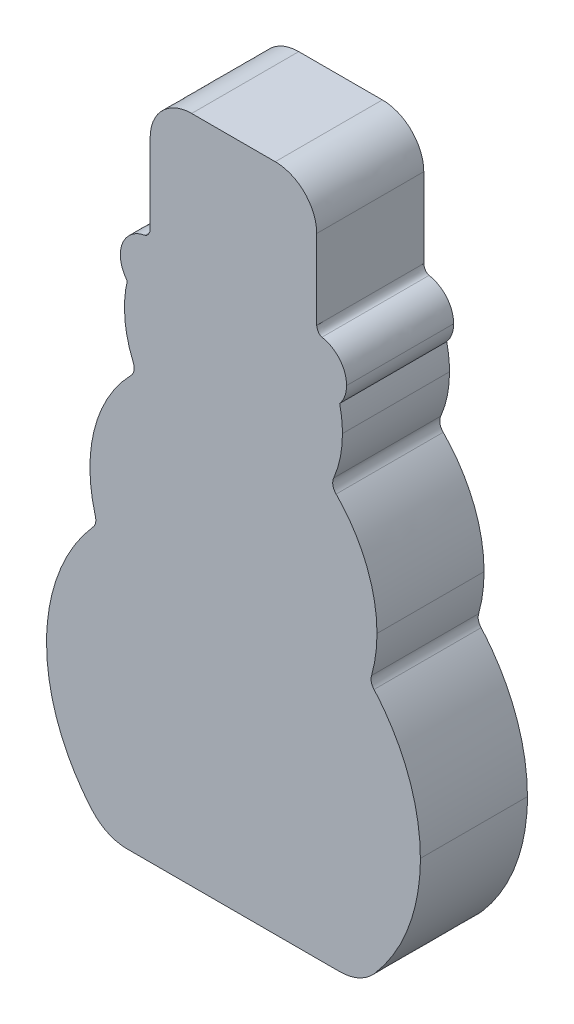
ISO-10303-21;
HEADER;
FILE_DESCRIPTION(('STEP AP214'),'2;1');
FILE_NAME('part.step','',(''),(''),'','','');
FILE_SCHEMA(('AUTOMOTIVE_DESIGN { 1 0 10303 214 1 1 1 1 }'));
ENDSEC;
DATA;
#1=APPLICATION_CONTEXT('core data for automotive mechanical design processes');
#2=APPLICATION_PROTOCOL_DEFINITION('international standard','automotive_design',2000,#1);
#3=PRODUCT_CONTEXT('',#1,'mechanical');
#4=PRODUCT('Part','Part','',(#3));
#5=PRODUCT_RELATED_PRODUCT_CATEGORY('part','',(#4));
#6=PRODUCT_DEFINITION_FORMATION('','',#4);
#7=PRODUCT_DEFINITION_CONTEXT('part definition',#1,'design');
#8=PRODUCT_DEFINITION('design','',#6,#7);
#9=PRODUCT_DEFINITION_SHAPE('','',#8);
#10=(LENGTH_UNIT() NAMED_UNIT(*) SI_UNIT(.MILLI.,.METRE.));
#11=(NAMED_UNIT(*) PLANE_ANGLE_UNIT() SI_UNIT($,.RADIAN.));
#12=(NAMED_UNIT(*) SI_UNIT($,.STERADIAN.) SOLID_ANGLE_UNIT());
#13=UNCERTAINTY_MEASURE_WITH_UNIT(LENGTH_MEASURE(1.E-05),#10,'distance_accuracy_value','');
#14=(GEOMETRIC_REPRESENTATION_CONTEXT(3) GLOBAL_UNCERTAINTY_ASSIGNED_CONTEXT((#13)) GLOBAL_UNIT_ASSIGNED_CONTEXT((#10,
#11,#12)) REPRESENTATION_CONTEXT('',''));
#15=CARTESIAN_POINT('',(0.,0.,0.));
#16=DIRECTION('',(0.,0.,1.));
#17=DIRECTION('',(1.,0.,0.));
#18=AXIS2_PLACEMENT_3D('',#15,#16,#17);
#19=CARTESIAN_POINT('',(451.275499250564,288.007793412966,8.));
#20=CARTESIAN_POINT('',(451.138199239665,287.415293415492,8.));
#21=CARTESIAN_POINT('',(451.065699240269,286.797993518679,8.));
#22=CARTESIAN_POINT('',(451.065699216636,286.163793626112,8.));
#23=B_SPLINE_CURVE_WITH_KNOTS('',3,(#19,#20,#21,#22),.UNSPECIFIED.,.F.,.F.,(4,4),
(0.939393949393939,1.),.UNSPECIFIED.);
#24=DIRECTION('',(0.,0.,-1.));
#25=VECTOR('',#24,1.);
#26=SURFACE_OF_LINEAR_EXTRUSION('',#23,#25);
#27=CARTESIAN_POINT('',(451.275499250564,288.007793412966,0.));
#28=CARTESIAN_POINT('',(451.138199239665,287.415293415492,0.));
#29=CARTESIAN_POINT('',(451.065699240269,286.797993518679,0.));
#30=CARTESIAN_POINT('',(451.065699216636,286.163793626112,0.));
#31=B_SPLINE_CURVE_WITH_KNOTS('',3,(#27,#28,#29,#30),.UNSPECIFIED.,.F.,.F.,(4,4),
(0.939393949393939,1.),.UNSPECIFIED.);
#32=CARTESIAN_POINT('',(451.275499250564,288.007793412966,0.));
#33=VERTEX_POINT('',#32);
#34=CARTESIAN_POINT('',(451.065699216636,286.163793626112,0.));
#35=VERTEX_POINT('',#34);
#36=EDGE_CURVE('E652',#33,#35,#31,.T.);
#37=ORIENTED_EDGE('',*,*,#36,.T.);
#38=DIRECTION('',(0.,0.,-1.));
#39=VECTOR('',#38,1.);
#40=CARTESIAN_POINT('',(451.065699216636,286.163793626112,8.));
#41=LINE('',#40,#39);
#42=CARTESIAN_POINT('',(451.065699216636,286.163793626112,8.));
#43=VERTEX_POINT('',#42);
#44=EDGE_CURVE('E11',#43,#35,#41,.T.);
#45=ORIENTED_EDGE('',*,*,#44,.F.);
#46=CARTESIAN_POINT('',(451.275499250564,288.007793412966,8.));
#47=VERTEX_POINT('',#46);
#48=EDGE_CURVE('E830',#47,#43,#23,.T.);
#49=ORIENTED_EDGE('',*,*,#48,.F.);
#50=DIRECTION('',(0.,0.,-1.));
#51=VECTOR('',#50,1.);
#52=CARTESIAN_POINT('',(451.275499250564,288.007793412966,8.));
#53=LINE('',#52,#51);
#54=EDGE_CURVE('E259',#47,#33,#53,.T.);
#55=ORIENTED_EDGE('',*,*,#54,.T.);
#56=EDGE_LOOP('',(#37,#45,#49,#55));
#57=FACE_BOUND('',#56,.T.);
#58=ADVANCED_FACE('F34',(#57),#26,.F.);
#59=CARTESIAN_POINT('',(451.065699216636,286.163793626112,8.));
#60=CARTESIAN_POINT('',(451.065699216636,285.064693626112,8.));
#61=CARTESIAN_POINT('',(451.285299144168,283.98009398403,8.));
#62=CARTESIAN_POINT('',(451.71689893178,282.969194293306,8.));
#63=B_SPLINE_CURVE_WITH_KNOTS('',3,(#59,#60,#61,#62),.UNSPECIFIED.,.F.,.F.,(4,4),
(0.909090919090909,0.939393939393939),.UNSPECIFIED.);
#64=DIRECTION('',(0.,0.,-1.));
#65=VECTOR('',#64,1.);
#66=SURFACE_OF_LINEAR_EXTRUSION('',#63,#65);
#67=CARTESIAN_POINT('',(451.065699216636,286.163793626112,0.));
#68=CARTESIAN_POINT('',(451.065699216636,285.064693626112,0.));
#69=CARTESIAN_POINT('',(451.285299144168,283.98009398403,0.));
#70=CARTESIAN_POINT('',(451.71689893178,282.969194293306,0.));
#71=B_SPLINE_CURVE_WITH_KNOTS('',3,(#67,#68,#69,#70),.UNSPECIFIED.,.F.,.F.,(4,4),
(0.909090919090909,0.939393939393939),.UNSPECIFIED.);
#72=CARTESIAN_POINT('',(451.71689893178,282.969194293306,0.));
#73=VERTEX_POINT('',#72);
#74=EDGE_CURVE('E646',#35,#73,#71,.T.);
#75=ORIENTED_EDGE('',*,*,#74,.T.);
#76=DIRECTION('',(0.,0.,-1.));
#77=VECTOR('',#76,1.);
#78=CARTESIAN_POINT('',(451.71689893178,282.969194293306,8.));
#79=LINE('',#78,#77);
#80=CARTESIAN_POINT('',(451.71689893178,282.969194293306,8.));
#81=VERTEX_POINT('',#80);
#82=EDGE_CURVE('E43',#81,#73,#79,.T.);
#83=ORIENTED_EDGE('',*,*,#82,.F.);
#84=EDGE_CURVE('E160',#43,#81,#63,.T.);
#85=ORIENTED_EDGE('',*,*,#84,.F.);
#86=ORIENTED_EDGE('',*,*,#44,.T.);
#87=EDGE_LOOP('',(#75,#83,#85,#86));
#88=FACE_BOUND('',#87,.T.);
#89=ADVANCED_FACE('F861',(#88),#66,.F.);
#90=CARTESIAN_POINT('',(451.71689893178,282.969194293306,8.));
#91=CARTESIAN_POINT('',(451.862498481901,282.628294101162,8.));
#92=CARTESIAN_POINT('',(451.797198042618,282.279094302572,8.));
#93=CARTESIAN_POINT('',(451.538097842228,282.013994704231,8.));
#94=B_SPLINE_CURVE_WITH_KNOTS('',3,(#90,#91,#92,#93),.UNSPECIFIED.,.F.,.F.,(4,4),
(0.878787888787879,0.909090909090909),.UNSPECIFIED.);
#95=DIRECTION('',(0.,0.,-1.));
#96=VECTOR('',#95,1.);
#97=SURFACE_OF_LINEAR_EXTRUSION('',#94,#96);
#98=CARTESIAN_POINT('',(451.71689893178,282.969194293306,0.));
#99=CARTESIAN_POINT('',(451.862498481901,282.628294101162,0.));
#100=CARTESIAN_POINT('',(451.797198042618,282.279094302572,0.));
#101=CARTESIAN_POINT('',(451.538097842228,282.013994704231,0.));
#102=B_SPLINE_CURVE_WITH_KNOTS('',3,(#98,#99,#100,#101),.UNSPECIFIED.,.F.,.F.,(4,4),
(0.878787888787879,0.909090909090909),.UNSPECIFIED.);
#103=CARTESIAN_POINT('',(451.538097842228,282.013994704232,0.));
#104=VERTEX_POINT('',#103);
#105=EDGE_CURVE('E640',#73,#104,#102,.T.);
#106=ORIENTED_EDGE('',*,*,#105,.T.);
#107=DIRECTION('',(0.,0.,-1.));
#108=VECTOR('',#107,1.);
#109=CARTESIAN_POINT('',(451.538097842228,282.013994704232,8.));
#110=LINE('',#109,#108);
#111=CARTESIAN_POINT('',(451.538097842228,282.013994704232,8.));
#112=VERTEX_POINT('',#111);
#113=EDGE_CURVE('E632',#112,#104,#110,.T.);
#114=ORIENTED_EDGE('',*,*,#113,.F.);
#115=EDGE_CURVE('E641',#81,#112,#94,.T.);
#116=ORIENTED_EDGE('',*,*,#115,.F.);
#117=ORIENTED_EDGE('',*,*,#82,.T.);
#118=EDGE_LOOP('',(#106,#114,#116,#117));
#119=FACE_BOUND('',#118,.T.);
#120=ADVANCED_FACE('F638',(#119),#97,.F.);
#121=CARTESIAN_POINT('',(451.538097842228,282.013994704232,8.));
#122=CARTESIAN_POINT('',(449.575298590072,280.00509397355,8.));
#123=CARTESIAN_POINT('',(448.485099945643,277.330094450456,8.));
#124=CARTESIAN_POINT('',(448.48510063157,274.521095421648,8.));
#125=B_SPLINE_CURVE_WITH_KNOTS('',3,(#121,#122,#123,#124),.UNSPECIFIED.,.F.,.F.,(4,4),
(0.848484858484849,0.878787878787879),.UNSPECIFIED.);
#126=DIRECTION('',(0.,0.,-1.));
#127=VECTOR('',#126,1.);
#128=SURFACE_OF_LINEAR_EXTRUSION('',#125,#127);
#129=CARTESIAN_POINT('',(451.538097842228,282.013994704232,0.));
#130=CARTESIAN_POINT('',(449.575298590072,280.00509397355,0.));
#131=CARTESIAN_POINT('',(448.485099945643,277.330094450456,0.));
#132=CARTESIAN_POINT('',(448.48510063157,274.521095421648,0.));
#133=B_SPLINE_CURVE_WITH_KNOTS('',3,(#129,#130,#131,#132),.UNSPECIFIED.,.F.,.F.,(4,4),
(0.848484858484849,0.878787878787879),.UNSPECIFIED.);
#134=CARTESIAN_POINT('',(448.48510063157,274.521095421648,0.));
#135=VERTEX_POINT('',#134);
#136=EDGE_CURVE('E648',#104,#135,#133,.T.);
#137=ORIENTED_EDGE('',*,*,#136,.T.);
#138=DIRECTION('',(0.,0.,-1.));
#139=VECTOR('',#138,1.);
#140=CARTESIAN_POINT('',(448.48510063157,274.521095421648,8.));
#141=LINE('',#140,#139);
#142=CARTESIAN_POINT('',(448.48510063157,274.521095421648,8.));
#143=VERTEX_POINT('',#142);
#144=EDGE_CURVE('E629',#143,#135,#141,.T.);
#145=ORIENTED_EDGE('',*,*,#144,.F.);
#146=EDGE_CURVE('E873',#112,#143,#125,.T.);
#147=ORIENTED_EDGE('',*,*,#146,.F.);
#148=ORIENTED_EDGE('',*,*,#113,.T.);
#149=EDGE_LOOP('',(#137,#145,#147,#148));
#150=FACE_BOUND('',#149,.T.);
#151=ADVANCED_FACE('F866',(#150),#128,.F.);
#152=CARTESIAN_POINT('',(448.48510063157,274.521095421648,8.));
#153=CARTESIAN_POINT('',(448.485100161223,273.534395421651,8.));
#154=CARTESIAN_POINT('',(448.619499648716,272.552295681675,8.));
#155=CARTESIAN_POINT('',(448.887699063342,271.602595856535,8.));
#156=B_SPLINE_CURVE_WITH_KNOTS('',3,(#152,#153,#154,#155),.UNSPECIFIED.,.F.,.F.,(4,4),
(0.818181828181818,0.848484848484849),.UNSPECIFIED.);
#157=DIRECTION('',(0.,0.,-1.));
#158=VECTOR('',#157,1.);
#159=SURFACE_OF_LINEAR_EXTRUSION('',#156,#158);
#160=CARTESIAN_POINT('',(448.48510063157,274.521095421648,0.));
#161=CARTESIAN_POINT('',(448.485100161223,273.534395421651,0.));
#162=CARTESIAN_POINT('',(448.619499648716,272.552295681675,0.));
#163=CARTESIAN_POINT('',(448.887699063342,271.602595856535,0.));
#164=B_SPLINE_CURVE_WITH_KNOTS('',3,(#160,#161,#162,#163),.UNSPECIFIED.,.F.,.F.,(4,4),
(0.818181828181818,0.848484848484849),.UNSPECIFIED.);
#165=CARTESIAN_POINT('',(448.887699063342,271.602595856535,0.));
#166=VERTEX_POINT('',#165);
#167=EDGE_CURVE('E650',#135,#166,#164,.T.);
#168=ORIENTED_EDGE('',*,*,#167,.T.);
#169=DIRECTION('',(0.,0.,-1.));
#170=VECTOR('',#169,1.);
#171=CARTESIAN_POINT('',(448.887699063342,271.602595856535,8.));
#172=LINE('',#171,#170);
#173=CARTESIAN_POINT('',(448.887699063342,271.602595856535,8.));
#174=VERTEX_POINT('',#173);
#175=EDGE_CURVE('E626',#174,#166,#172,.T.);
#176=ORIENTED_EDGE('',*,*,#175,.F.);
#177=EDGE_CURVE('E877',#143,#174,#156,.T.);
#178=ORIENTED_EDGE('',*,*,#177,.F.);
#179=ORIENTED_EDGE('',*,*,#144,.T.);
#180=EDGE_LOOP('',(#168,#176,#178,#179));
#181=FACE_BOUND('',#180,.T.);
#182=ADVANCED_FACE('F869',(#181),#159,.F.);
#183=CARTESIAN_POINT('',(448.887699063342,271.602595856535,8.));
#184=CARTESIAN_POINT('',(448.974198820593,271.296395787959,8.));
#185=CARTESIAN_POINT('',(448.913398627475,271.027495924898,8.));
#186=CARTESIAN_POINT('',(448.703598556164,270.788196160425,8.));
#187=B_SPLINE_CURVE_WITH_KNOTS('',3,(#183,#184,#185,#186),.UNSPECIFIED.,.F.,.F.,(4,4),
(0.787878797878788,0.818181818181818),.UNSPECIFIED.);
#188=DIRECTION('',(0.,0.,-1.));
#189=VECTOR('',#188,1.);
#190=SURFACE_OF_LINEAR_EXTRUSION('',#187,#189);
#191=CARTESIAN_POINT('',(448.887699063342,271.602595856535,0.));
#192=CARTESIAN_POINT('',(448.974198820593,271.296395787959,0.));
#193=CARTESIAN_POINT('',(448.913398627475,271.027495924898,0.));
#194=CARTESIAN_POINT('',(448.703598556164,270.788196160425,0.));
#195=B_SPLINE_CURVE_WITH_KNOTS('',3,(#191,#192,#193,#194),.UNSPECIFIED.,.F.,.F.,(4,4),
(0.787878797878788,0.818181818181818),.UNSPECIFIED.);
#196=CARTESIAN_POINT('',(448.703598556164,270.788196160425,0.));
#197=VERTEX_POINT('',#196);
#198=EDGE_CURVE('E670',#166,#197,#195,.T.);
#199=ORIENTED_EDGE('',*,*,#198,.T.);
#200=DIRECTION('',(0.,0.,-1.));
#201=VECTOR('',#200,1.);
#202=CARTESIAN_POINT('',(448.703598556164,270.788196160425,8.));
#203=LINE('',#202,#201);
#204=CARTESIAN_POINT('',(448.703598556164,270.788196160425,8.));
#205=VERTEX_POINT('',#204);
#206=EDGE_CURVE('E623',#205,#197,#203,.T.);
#207=ORIENTED_EDGE('',*,*,#206,.F.);
#208=EDGE_CURVE('E885',#174,#205,#187,.T.);
#209=ORIENTED_EDGE('',*,*,#208,.F.);
#210=ORIENTED_EDGE('',*,*,#175,.T.);
#211=EDGE_LOOP('',(#199,#207,#209,#210));
#212=FACE_BOUND('',#211,.T.);
#213=ADVANCED_FACE('F899',(#212),#190,.F.);
#214=CARTESIAN_POINT('',(448.703598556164,270.788196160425,8.));
#215=CARTESIAN_POINT('',(446.465799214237,268.234995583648,8.));
#216=CARTESIAN_POINT('',(445.244100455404,264.983696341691,8.));
#217=CARTESIAN_POINT('',(445.244100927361,261.588397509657,8.));
#218=B_SPLINE_CURVE_WITH_KNOTS('',3,(#214,#215,#216,#217),.UNSPECIFIED.,.F.,.F.,(4,4),
(0.757575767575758,0.787878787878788),.UNSPECIFIED.);
#219=DIRECTION('',(0.,0.,-1.));
#220=VECTOR('',#219,1.);
#221=SURFACE_OF_LINEAR_EXTRUSION('',#218,#220);
#222=CARTESIAN_POINT('',(448.703598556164,270.788196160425,0.));
#223=CARTESIAN_POINT('',(446.465799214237,268.234995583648,0.));
#224=CARTESIAN_POINT('',(445.244100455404,264.983696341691,0.));
#225=CARTESIAN_POINT('',(445.244100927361,261.588397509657,0.));
#226=B_SPLINE_CURVE_WITH_KNOTS('',3,(#222,#223,#224,#225),.UNSPECIFIED.,.F.,.F.,(4,4),
(0.757575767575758,0.787878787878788),.UNSPECIFIED.);
#227=CARTESIAN_POINT('',(445.244100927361,261.588397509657,0.));
#228=VERTEX_POINT('',#227);
#229=EDGE_CURVE('E677',#197,#228,#226,.T.);
#230=ORIENTED_EDGE('',*,*,#229,.T.);
#231=DIRECTION('',(0.,0.,-1.));
#232=VECTOR('',#231,1.);
#233=CARTESIAN_POINT('',(445.244100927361,261.588397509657,8.));
#234=LINE('',#233,#232);
#235=CARTESIAN_POINT('',(445.244100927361,261.588397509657,8.));
#236=VERTEX_POINT('',#235);
#237=EDGE_CURVE('E620',#236,#228,#234,.T.);
#238=ORIENTED_EDGE('',*,*,#237,.F.);
#239=EDGE_CURVE('E892',#205,#236,#218,.T.);
#240=ORIENTED_EDGE('',*,*,#239,.F.);
#241=ORIENTED_EDGE('',*,*,#206,.T.);
#242=EDGE_LOOP('',(#230,#238,#240,#241));
#243=FACE_BOUND('',#242,.T.);
#244=ADVANCED_FACE('F901',(#243),#221,.F.);
#245=CARTESIAN_POINT('',(445.244100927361,261.588397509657,8.));
#246=CARTESIAN_POINT('',(445.244101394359,258.224197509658,8.));
#247=CARTESIAN_POINT('',(446.443501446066,255.000398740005,8.));
#248=CARTESIAN_POINT('',(448.644700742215,252.456399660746,8.));
#249=B_SPLINE_CURVE_WITH_KNOTS('',3,(#245,#246,#247,#248),.UNSPECIFIED.,.F.,.F.,(4,4),
(0.727272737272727,0.757575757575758),.UNSPECIFIED.);
#250=DIRECTION('',(0.,0.,-1.));
#251=VECTOR('',#250,1.);
#252=SURFACE_OF_LINEAR_EXTRUSION('',#249,#251);
#253=CARTESIAN_POINT('',(445.244100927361,261.588397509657,0.));
#254=CARTESIAN_POINT('',(445.244101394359,258.224197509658,0.));
#255=CARTESIAN_POINT('',(446.443501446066,255.000398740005,0.));
#256=CARTESIAN_POINT('',(448.644700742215,252.456399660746,0.));
#257=B_SPLINE_CURVE_WITH_KNOTS('',3,(#253,#254,#255,#256),.UNSPECIFIED.,.F.,.F.,(4,4),
(0.727272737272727,0.757575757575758),.UNSPECIFIED.);
#258=CARTESIAN_POINT('',(448.644700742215,252.456399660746,0.));
#259=VERTEX_POINT('',#258);
#260=EDGE_CURVE('E684',#228,#259,#257,.T.);
#261=ORIENTED_EDGE('',*,*,#260,.T.);
#262=DIRECTION('',(0.,0.,-1.));
#263=VECTOR('',#262,1.);
#264=CARTESIAN_POINT('',(448.644700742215,252.456399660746,8.));
#265=LINE('',#264,#263);
#266=CARTESIAN_POINT('',(448.644700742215,252.456399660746,8.));
#267=VERTEX_POINT('',#266);
#268=EDGE_CURVE('E617',#267,#259,#265,.T.);
#269=ORIENTED_EDGE('',*,*,#268,.F.);
#270=EDGE_CURVE('E480',#236,#267,#249,.T.);
#271=ORIENTED_EDGE('',*,*,#270,.F.);
#272=ORIENTED_EDGE('',*,*,#237,.T.);
#273=EDGE_LOOP('',(#261,#269,#271,#272));
#274=FACE_BOUND('',#273,.T.);
#275=ADVANCED_FACE('F471',(#274),#252,.F.);
#276=CARTESIAN_POINT('',(448.644700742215,252.456399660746,8.));
#277=CARTESIAN_POINT('',(449.324500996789,251.670799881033,8.));
#278=CARTESIAN_POINT('',(450.252900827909,251.246500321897,8.));
#279=CARTESIAN_POINT('',(451.29170044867,251.246500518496,8.));
#280=B_SPLINE_CURVE_WITH_KNOTS('',3,(#276,#277,#278,#279),.UNSPECIFIED.,.F.,.F.,(4,4),
(0.696969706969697,0.727272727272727),.UNSPECIFIED.);
#281=DIRECTION('',(0.,0.,-1.));
#282=VECTOR('',#281,1.);
#283=SURFACE_OF_LINEAR_EXTRUSION('',#280,#282);
#284=CARTESIAN_POINT('',(448.644700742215,252.456399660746,0.));
#285=CARTESIAN_POINT('',(449.324500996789,251.670799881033,0.));
#286=CARTESIAN_POINT('',(450.252900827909,251.246500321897,0.));
#287=CARTESIAN_POINT('',(451.29170044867,251.246500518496,0.));
#288=B_SPLINE_CURVE_WITH_KNOTS('',3,(#284,#285,#286,#287),.UNSPECIFIED.,.F.,.F.,(4,4),
(0.696969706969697,0.727272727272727),.UNSPECIFIED.);
#289=CARTESIAN_POINT('',(451.29170044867,251.246500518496,0.));
#290=VERTEX_POINT('',#289);
#291=EDGE_CURVE('E691',#259,#290,#288,.T.);
#292=ORIENTED_EDGE('',*,*,#291,.T.);
#293=DIRECTION('',(0.,0.,-1.));
#294=VECTOR('',#293,1.);
#295=CARTESIAN_POINT('',(451.29170044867,251.246500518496,8.));
#296=LINE('',#295,#294);
#297=CARTESIAN_POINT('',(451.29170044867,251.246500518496,8.));
#298=VERTEX_POINT('',#297);
#299=EDGE_CURVE('E614',#298,#290,#296,.T.);
#300=ORIENTED_EDGE('',*,*,#299,.F.);
#301=EDGE_CURVE('E475',#267,#298,#280,.T.);
#302=ORIENTED_EDGE('',*,*,#301,.F.);
#303=ORIENTED_EDGE('',*,*,#268,.T.);
#304=EDGE_LOOP('',(#292,#300,#302,#303));
#305=FACE_BOUND('',#304,.T.);
#306=ADVANCED_FACE('F466',(#305),#283,.F.);
#307=CARTESIAN_POINT('',(451.29170044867,251.246500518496,8.));
#308=DIRECTION('',(0.,1.,0.));
#309=DIRECTION('',(0.,0.,1.));
#310=AXIS2_PLACEMENT_3D('',#307,#308,#309);
#311=PLANE('',#310);
#312=CARTESIAN_POINT('',(451.29170044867,251.246500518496,0.));
#313=CARTESIAN_POINT('',(467.125095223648,251.246500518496,0.));
#314=CARTESIAN_POINT('',(467.125100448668,251.246500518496,0.));
#315=B_SPLINE_CURVE_WITH_KNOTS('',2,(#312,#313,#314),.UNSPECIFIED.,.F.,.F.,(3,3),
(0.666666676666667,0.696969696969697),.UNSPECIFIED.);
#316=CARTESIAN_POINT('',(467.125100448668,251.246500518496,0.));
#317=VERTEX_POINT('',#316);
#318=EDGE_CURVE('E698',#290,#317,#315,.T.);
#319=ORIENTED_EDGE('',*,*,#318,.T.);
#320=DIRECTION('',(0.,0.,-1.));
#321=VECTOR('',#320,1.);
#322=CARTESIAN_POINT('',(467.125100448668,251.246500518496,8.));
#323=LINE('',#322,#321);
#324=CARTESIAN_POINT('',(467.125100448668,251.246500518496,8.));
#325=VERTEX_POINT('',#324);
#326=EDGE_CURVE('E505',#325,#317,#323,.T.);
#327=ORIENTED_EDGE('',*,*,#326,.F.);
#328=CARTESIAN_POINT('',(451.29170044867,251.246500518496,8.));
#329=CARTESIAN_POINT('',(467.125095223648,251.246500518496,8.));
#330=CARTESIAN_POINT('',(467.125100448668,251.246500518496,8.));
#331=B_SPLINE_CURVE_WITH_KNOTS('',2,(#328,#329,#330),.UNSPECIFIED.,.F.,.F.,(3,3),
(0.666666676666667,0.696969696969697),.UNSPECIFIED.);
#332=EDGE_CURVE('E479',#298,#325,#331,.T.);
#333=ORIENTED_EDGE('',*,*,#332,.F.);
#334=ORIENTED_EDGE('',*,*,#299,.T.);
#335=EDGE_LOOP('',(#319,#327,#333,#334));
#336=FACE_BOUND('',#335,.T.);
#337=ADVANCED_FACE('F462',(#336),#311,.F.);
#338=CARTESIAN_POINT('',(467.125100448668,251.246500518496,8.));
#339=CARTESIAN_POINT('',(468.163900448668,251.246500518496,8.));
#340=CARTESIAN_POINT('',(469.092300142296,251.670800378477,8.));
#341=CARTESIAN_POINT('',(469.7721,252.4564,8.));
#342=B_SPLINE_CURVE_WITH_KNOTS('',3,(#338,#339,#340,#341),.UNSPECIFIED.,.F.,.F.,(4,4),
(0.636363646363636,0.666666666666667),.UNSPECIFIED.);
#343=DIRECTION('',(0.,0.,-1.));
#344=VECTOR('',#343,1.);
#345=SURFACE_OF_LINEAR_EXTRUSION('',#342,#344);
#346=CARTESIAN_POINT('',(467.125100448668,251.246500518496,0.));
#347=CARTESIAN_POINT('',(468.163900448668,251.246500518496,0.));
#348=CARTESIAN_POINT('',(469.092300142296,251.670800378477,0.));
#349=CARTESIAN_POINT('',(469.7721,252.4564,0.));
#350=B_SPLINE_CURVE_WITH_KNOTS('',3,(#346,#347,#348,#349),.UNSPECIFIED.,.F.,.F.,(4,4),
(0.636363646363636,0.666666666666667),.UNSPECIFIED.);
#351=CARTESIAN_POINT('',(469.7721,252.4564,0.));
#352=VERTEX_POINT('',#351);
#353=EDGE_CURVE('E503',#317,#352,#350,.T.);
#354=ORIENTED_EDGE('',*,*,#353,.T.);
#355=DIRECTION('',(0.,0.,-1.));
#356=VECTOR('',#355,1.);
#357=CARTESIAN_POINT('',(469.7721,252.4564,8.));
#358=LINE('',#357,#356);
#359=CARTESIAN_POINT('',(469.7721,252.4564,8.));
#360=VERTEX_POINT('',#359);
#361=EDGE_CURVE('E501',#360,#352,#358,.T.);
#362=ORIENTED_EDGE('',*,*,#361,.F.);
#363=EDGE_CURVE('E447',#325,#360,#342,.T.);
#364=ORIENTED_EDGE('',*,*,#363,.F.);
#365=ORIENTED_EDGE('',*,*,#326,.T.);
#366=EDGE_LOOP('',(#354,#362,#364,#365));
#367=FACE_BOUND('',#366,.T.);
#368=ADVANCED_FACE('F458',(#367),#345,.F.);
#369=CARTESIAN_POINT('',(469.7721,252.4564,8.));
#370=CARTESIAN_POINT('',(471.9733,255.0004,8.));
#371=CARTESIAN_POINT('',(473.172699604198,258.224198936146,8.));
#372=CARTESIAN_POINT('',(473.1727,261.588397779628,8.));
#373=B_SPLINE_CURVE_WITH_KNOTS('',3,(#369,#370,#371,#372),.UNSPECIFIED.,.F.,.F.,(4,4),
(0.606060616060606,0.636363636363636),.UNSPECIFIED.);
#374=DIRECTION('',(0.,0.,-1.));
#375=VECTOR('',#374,1.);
#376=SURFACE_OF_LINEAR_EXTRUSION('',#373,#375);
#377=CARTESIAN_POINT('',(469.7721,252.4564,0.));
#378=CARTESIAN_POINT('',(471.9733,255.0004,0.));
#379=CARTESIAN_POINT('',(473.172699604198,258.224198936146,0.));
#380=CARTESIAN_POINT('',(473.1727,261.588397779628,0.));
#381=B_SPLINE_CURVE_WITH_KNOTS('',3,(#377,#378,#379,#380),.UNSPECIFIED.,.F.,.F.,(4,4),
(0.606060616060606,0.636363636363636),.UNSPECIFIED.);
#382=CARTESIAN_POINT('',(473.1727,261.588397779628,0.));
#383=VERTEX_POINT('',#382);
#384=EDGE_CURVE('E510',#352,#383,#381,.T.);
#385=ORIENTED_EDGE('',*,*,#384,.T.);
#386=DIRECTION('',(0.,0.,-1.));
#387=VECTOR('',#386,1.);
#388=CARTESIAN_POINT('',(473.1727,261.588397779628,8.));
#389=LINE('',#388,#387);
#390=CARTESIAN_POINT('',(473.1727,261.588397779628,8.));
#391=VERTEX_POINT('',#390);
#392=EDGE_CURVE('E506',#391,#383,#389,.T.);
#393=ORIENTED_EDGE('',*,*,#392,.F.);
#394=EDGE_CURVE('E439',#360,#391,#373,.T.);
#395=ORIENTED_EDGE('',*,*,#394,.F.);
#396=ORIENTED_EDGE('',*,*,#361,.T.);
#397=EDGE_LOOP('',(#385,#393,#395,#396));
#398=FACE_BOUND('',#397,.T.);
#399=ADVANCED_FACE('F455',(#398),#376,.F.);
#400=CARTESIAN_POINT('',(473.1727,261.588397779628,8.));
#401=CARTESIAN_POINT('',(473.172700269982,264.983697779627,8.));
#402=CARTESIAN_POINT('',(471.950900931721,268.235196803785,8.));
#403=CARTESIAN_POINT('',(469.713002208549,270.788296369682,8.));
#404=B_SPLINE_CURVE_WITH_KNOTS('',3,(#400,#401,#402,#403),.UNSPECIFIED.,.F.,.F.,(4,4),
(0.575757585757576,0.606060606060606),.UNSPECIFIED.);
#405=DIRECTION('',(0.,0.,-1.));
#406=VECTOR('',#405,1.);
#407=SURFACE_OF_LINEAR_EXTRUSION('',#404,#406);
#408=CARTESIAN_POINT('',(473.1727,261.588397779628,0.));
#409=CARTESIAN_POINT('',(473.172700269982,264.983697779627,0.));
#410=CARTESIAN_POINT('',(471.950900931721,268.235196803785,0.));
#411=CARTESIAN_POINT('',(469.713002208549,270.788296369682,0.));
#412=B_SPLINE_CURVE_WITH_KNOTS('',3,(#408,#409,#410,#411),.UNSPECIFIED.,.F.,.F.,(4,4),
(0.575757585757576,0.606060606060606),.UNSPECIFIED.);
#413=CARTESIAN_POINT('',(469.713002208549,270.788296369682,0.));
#414=VERTEX_POINT('',#413);
#415=EDGE_CURVE('E717',#383,#414,#412,.T.);
#416=ORIENTED_EDGE('',*,*,#415,.T.);
#417=DIRECTION('',(0.,0.,-1.));
#418=VECTOR('',#417,1.);
#419=CARTESIAN_POINT('',(469.713002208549,270.788296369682,8.));
#420=LINE('',#419,#418);
#421=CARTESIAN_POINT('',(469.713002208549,270.788296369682,8.));
#422=VERTEX_POINT('',#421);
#423=EDGE_CURVE('E513',#422,#414,#420,.T.);
#424=ORIENTED_EDGE('',*,*,#423,.F.);
#425=EDGE_CURVE('E431',#391,#422,#404,.T.);
#426=ORIENTED_EDGE('',*,*,#425,.F.);
#427=ORIENTED_EDGE('',*,*,#392,.T.);
#428=EDGE_LOOP('',(#416,#424,#426,#427));
#429=FACE_BOUND('',#428,.T.);
#430=ADVANCED_FACE('F423',(#429),#407,.F.);
#431=CARTESIAN_POINT('',(469.713002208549,270.788296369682,8.));
#432=CARTESIAN_POINT('',(469.503201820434,271.027696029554,8.));
#433=CARTESIAN_POINT('',(469.442301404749,271.296495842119,8.));
#434=CARTESIAN_POINT('',(469.528900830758,271.602895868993,8.));
#435=B_SPLINE_CURVE_WITH_KNOTS('',3,(#431,#432,#433,#434),.UNSPECIFIED.,.F.,.F.,(4,4),
(0.545454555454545,0.575757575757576),.UNSPECIFIED.);
#436=DIRECTION('',(0.,0.,-1.));
#437=VECTOR('',#436,1.);
#438=SURFACE_OF_LINEAR_EXTRUSION('',#435,#437);
#439=CARTESIAN_POINT('',(469.713002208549,270.788296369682,0.));
#440=CARTESIAN_POINT('',(469.503201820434,271.027696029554,0.));
#441=CARTESIAN_POINT('',(469.442301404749,271.296495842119,0.));
#442=CARTESIAN_POINT('',(469.528900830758,271.602895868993,0.));
#443=B_SPLINE_CURVE_WITH_KNOTS('',3,(#439,#440,#441,#442),.UNSPECIFIED.,.F.,.F.,(4,4),
(0.545454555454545,0.575757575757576),.UNSPECIFIED.);
#444=CARTESIAN_POINT('',(469.528900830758,271.602895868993,0.));
#445=VERTEX_POINT('',#444);
#446=EDGE_CURVE('E524',#414,#445,#443,.T.);
#447=ORIENTED_EDGE('',*,*,#446,.T.);
#448=DIRECTION('',(0.,0.,-1.));
#449=VECTOR('',#448,1.);
#450=CARTESIAN_POINT('',(469.528900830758,271.602895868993,8.));
#451=LINE('',#450,#449);
#452=CARTESIAN_POINT('',(469.528900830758,271.602895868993,8.));
#453=VERTEX_POINT('',#452);
#454=EDGE_CURVE('E522',#453,#445,#451,.T.);
#455=ORIENTED_EDGE('',*,*,#454,.F.);
#456=EDGE_CURVE('E427',#422,#453,#435,.T.);
#457=ORIENTED_EDGE('',*,*,#456,.F.);
#458=ORIENTED_EDGE('',*,*,#423,.T.);
#459=EDGE_LOOP('',(#447,#455,#457,#458));
#460=FACE_BOUND('',#459,.T.);
#461=ADVANCED_FACE('F419',(#460),#438,.F.);
#462=CARTESIAN_POINT('',(469.528900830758,271.602895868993,8.));
#463=CARTESIAN_POINT('',(469.797200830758,272.552395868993,8.));
#464=CARTESIAN_POINT('',(469.931500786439,273.5344955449,8.));
#465=CARTESIAN_POINT('',(469.931500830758,274.521095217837,8.));
#466=B_SPLINE_CURVE_WITH_KNOTS('',3,(#462,#463,#464,#465),.UNSPECIFIED.,.F.,.F.,(4,4),
(0.515151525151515,0.545454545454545),.UNSPECIFIED.);
#467=DIRECTION('',(0.,0.,-1.));
#468=VECTOR('',#467,1.);
#469=SURFACE_OF_LINEAR_EXTRUSION('',#466,#468);
#470=CARTESIAN_POINT('',(469.528900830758,271.602895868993,0.));
#471=CARTESIAN_POINT('',(469.797200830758,272.552395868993,0.));
#472=CARTESIAN_POINT('',(469.931500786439,273.5344955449,0.));
#473=CARTESIAN_POINT('',(469.931500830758,274.521095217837,0.));
#474=B_SPLINE_CURVE_WITH_KNOTS('',3,(#470,#471,#472,#473),.UNSPECIFIED.,.F.,.F.,(4,4),
(0.515151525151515,0.545454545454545),.UNSPECIFIED.);
#475=CARTESIAN_POINT('',(469.931500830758,274.521095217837,0.));
#476=VERTEX_POINT('',#475);
#477=EDGE_CURVE('E530',#445,#476,#474,.T.);
#478=ORIENTED_EDGE('',*,*,#477,.T.);
#479=DIRECTION('',(0.,0.,-1.));
#480=VECTOR('',#479,1.);
#481=CARTESIAN_POINT('',(469.931500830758,274.521095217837,8.));
#482=LINE('',#481,#480);
#483=CARTESIAN_POINT('',(469.931500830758,274.521095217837,8.));
#484=VERTEX_POINT('',#483);
#485=EDGE_CURVE('E526',#484,#476,#482,.T.);
#486=ORIENTED_EDGE('',*,*,#485,.F.);
#487=EDGE_CURVE('E404',#453,#484,#466,.T.);
#488=ORIENTED_EDGE('',*,*,#487,.F.);
#489=ORIENTED_EDGE('',*,*,#454,.T.);
#490=EDGE_LOOP('',(#478,#486,#488,#489));
#491=FACE_BOUND('',#490,.T.);
#492=ADVANCED_FACE('F415',(#491),#469,.F.);
#493=CARTESIAN_POINT('',(469.931500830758,274.521095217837,8.));
#494=CARTESIAN_POINT('',(469.931501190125,277.330095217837,8.));
#495=CARTESIAN_POINT('',(468.841301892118,280.005094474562,8.));
#496=CARTESIAN_POINT('',(466.878503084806,282.013994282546,8.));
#497=B_SPLINE_CURVE_WITH_KNOTS('',3,(#493,#494,#495,#496),.UNSPECIFIED.,.F.,.F.,(4,4),
(0.484848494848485,0.515151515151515),.UNSPECIFIED.);
#498=DIRECTION('',(0.,0.,-1.));
#499=VECTOR('',#498,1.);
#500=SURFACE_OF_LINEAR_EXTRUSION('',#497,#499);
#501=CARTESIAN_POINT('',(469.931500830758,274.521095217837,0.));
#502=CARTESIAN_POINT('',(469.931501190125,277.330095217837,0.));
#503=CARTESIAN_POINT('',(468.841301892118,280.005094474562,0.));
#504=CARTESIAN_POINT('',(466.878503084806,282.013994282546,0.));
#505=B_SPLINE_CURVE_WITH_KNOTS('',3,(#501,#502,#503,#504),.UNSPECIFIED.,.F.,.F.,(4,4),
(0.484848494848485,0.515151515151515),.UNSPECIFIED.);
#506=CARTESIAN_POINT('',(466.878503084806,282.013994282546,0.));
#507=VERTEX_POINT('',#506);
#508=EDGE_CURVE('E736',#476,#507,#505,.T.);
#509=ORIENTED_EDGE('',*,*,#508,.T.);
#510=DIRECTION('',(0.,0.,-1.));
#511=VECTOR('',#510,1.);
#512=CARTESIAN_POINT('',(466.878503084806,282.013994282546,8.));
#513=LINE('',#512,#511);
#514=CARTESIAN_POINT('',(466.878503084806,282.013994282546,8.));
#515=VERTEX_POINT('',#514);
#516=EDGE_CURVE('E532',#515,#507,#513,.T.);
#517=ORIENTED_EDGE('',*,*,#516,.F.);
#518=EDGE_CURVE('E396',#484,#515,#497,.T.);
#519=ORIENTED_EDGE('',*,*,#518,.F.);
#520=ORIENTED_EDGE('',*,*,#485,.T.);
#521=EDGE_LOOP('',(#509,#517,#519,#520));
#522=FACE_BOUND('',#521,.T.);
#523=ADVANCED_FACE('F412',(#522),#500,.F.);
#524=CARTESIAN_POINT('',(466.878503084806,282.013994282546,8.));
#525=CARTESIAN_POINT('',(466.619402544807,282.279093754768,8.));
#526=CARTESIAN_POINT('',(466.554101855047,282.628293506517,8.));
#527=CARTESIAN_POINT('',(466.699601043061,282.969193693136,8.));
#528=B_SPLINE_CURVE_WITH_KNOTS('',3,(#524,#525,#526,#527),.UNSPECIFIED.,.F.,.F.,(4,4),
(0.454545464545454,0.484848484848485),.UNSPECIFIED.);
#529=DIRECTION('',(0.,0.,-1.));
#530=VECTOR('',#529,1.);
#531=SURFACE_OF_LINEAR_EXTRUSION('',#528,#530);
#532=CARTESIAN_POINT('',(466.878503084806,282.013994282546,0.));
#533=CARTESIAN_POINT('',(466.619402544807,282.279093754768,0.));
#534=CARTESIAN_POINT('',(466.554101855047,282.628293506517,0.));
#535=CARTESIAN_POINT('',(466.699601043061,282.969193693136,0.));
#536=B_SPLINE_CURVE_WITH_KNOTS('',3,(#532,#533,#534,#535),.UNSPECIFIED.,.F.,.F.,(4,4),
(0.454545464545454,0.484848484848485),.UNSPECIFIED.);
#537=CARTESIAN_POINT('',(466.699601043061,282.969193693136,0.));
#538=VERTEX_POINT('',#537);
#539=EDGE_CURVE('E544',#507,#538,#536,.T.);
#540=ORIENTED_EDGE('',*,*,#539,.T.);
#541=DIRECTION('',(0.,0.,-1.));
#542=VECTOR('',#541,1.);
#543=CARTESIAN_POINT('',(466.699601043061,282.969193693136,8.));
#544=LINE('',#543,#542);
#545=CARTESIAN_POINT('',(466.699601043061,282.969193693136,8.));
#546=VERTEX_POINT('',#545);
#547=EDGE_CURVE('E542',#546,#538,#544,.T.);
#548=ORIENTED_EDGE('',*,*,#547,.F.);
#549=EDGE_CURVE('E388',#515,#546,#528,.T.);
#550=ORIENTED_EDGE('',*,*,#549,.F.);
#551=ORIENTED_EDGE('',*,*,#516,.T.);
#552=EDGE_LOOP('',(#540,#548,#550,#551));
#553=FACE_BOUND('',#552,.T.);
#554=ADVANCED_FACE('F380',(#553),#531,.F.);
#555=CARTESIAN_POINT('',(466.699601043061,282.969193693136,8.));
#556=CARTESIAN_POINT('',(467.131300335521,283.980093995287,8.));
#557=CARTESIAN_POINT('',(467.350899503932,285.064693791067,8.));
#558=CARTESIAN_POINT('',(467.350898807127,286.163793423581,8.));
#559=B_SPLINE_CURVE_WITH_KNOTS('',3,(#555,#556,#557,#558),.UNSPECIFIED.,.F.,.F.,(4,4),
(0.424242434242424,0.454545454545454),.UNSPECIFIED.);
#560=DIRECTION('',(0.,0.,-1.));
#561=VECTOR('',#560,1.);
#562=SURFACE_OF_LINEAR_EXTRUSION('',#559,#561);
#563=CARTESIAN_POINT('',(466.699601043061,282.969193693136,0.));
#564=CARTESIAN_POINT('',(467.131300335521,283.980093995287,0.));
#565=CARTESIAN_POINT('',(467.350899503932,285.064693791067,0.));
#566=CARTESIAN_POINT('',(467.350898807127,286.163793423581,0.));
#567=B_SPLINE_CURVE_WITH_KNOTS('',3,(#563,#564,#565,#566),.UNSPECIFIED.,.F.,.F.,(4,4),
(0.424242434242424,0.454545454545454),.UNSPECIFIED.);
#568=CARTESIAN_POINT('',(467.350898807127,286.163793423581,0.));
#569=VERTEX_POINT('',#568);
#570=EDGE_CURVE('E550',#538,#569,#567,.T.);
#571=ORIENTED_EDGE('',*,*,#570,.T.);
#572=DIRECTION('',(0.,0.,-1.));
#573=VECTOR('',#572,1.);
#574=CARTESIAN_POINT('',(467.350898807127,286.163793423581,8.));
#575=LINE('',#574,#573);
#576=CARTESIAN_POINT('',(467.350898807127,286.163793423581,8.));
#577=VERTEX_POINT('',#576);
#578=EDGE_CURVE('E546',#577,#569,#575,.T.);
#579=ORIENTED_EDGE('',*,*,#578,.F.);
#580=EDGE_CURVE('E384',#546,#577,#559,.T.);
#581=ORIENTED_EDGE('',*,*,#580,.F.);
#582=ORIENTED_EDGE('',*,*,#547,.T.);
#583=EDGE_LOOP('',(#571,#579,#581,#582));
#584=FACE_BOUND('',#583,.T.);
#585=ADVANCED_FACE('F376',(#584),#562,.F.);
#586=CARTESIAN_POINT('',(467.350898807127,286.163793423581,8.));
#587=CARTESIAN_POINT('',(467.350899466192,286.797993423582,8.));
#588=CARTESIAN_POINT('',(467.278400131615,287.415293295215,8.));
#589=CARTESIAN_POINT('',(467.141100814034,288.007793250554,8.));
#590=B_SPLINE_CURVE_WITH_KNOTS('',3,(#586,#587,#588,#589),.UNSPECIFIED.,.F.,.F.,(4,4),
(0.393939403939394,0.424242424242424),.UNSPECIFIED.);
#591=DIRECTION('',(0.,0.,-1.));
#592=VECTOR('',#591,1.);
#593=SURFACE_OF_LINEAR_EXTRUSION('',#590,#592);
#594=CARTESIAN_POINT('',(467.350898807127,286.163793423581,0.));
#595=CARTESIAN_POINT('',(467.350899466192,286.797993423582,0.));
#596=CARTESIAN_POINT('',(467.278400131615,287.415293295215,0.));
#597=CARTESIAN_POINT('',(467.141100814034,288.007793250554,0.));
#598=B_SPLINE_CURVE_WITH_KNOTS('',3,(#594,#595,#596,#597),.UNSPECIFIED.,.F.,.F.,(4,4),
(0.393939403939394,0.424242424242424),.UNSPECIFIED.);
#599=CARTESIAN_POINT('',(467.141100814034,288.007793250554,0.));
#600=VERTEX_POINT('',#599);
#601=EDGE_CURVE('E755',#569,#600,#598,.T.);
#602=ORIENTED_EDGE('',*,*,#601,.T.);
#603=DIRECTION('',(0.,0.,-1.));
#604=VECTOR('',#603,1.);
#605=CARTESIAN_POINT('',(467.141100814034,288.007793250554,8.));
#606=LINE('',#605,#604);
#607=CARTESIAN_POINT('',(467.141100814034,288.007793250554,8.));
#608=VERTEX_POINT('',#607);
#609=EDGE_CURVE('E552',#608,#600,#606,.T.);
#610=ORIENTED_EDGE('',*,*,#609,.F.);
#611=EDGE_CURVE('E361',#577,#608,#590,.T.);
#612=ORIENTED_EDGE('',*,*,#611,.F.);
#613=ORIENTED_EDGE('',*,*,#578,.T.);
#614=EDGE_LOOP('',(#602,#610,#612,#613));
#615=FACE_BOUND('',#614,.T.);
#616=ADVANCED_FACE('F372',(#615),#593,.F.);
#617=CARTESIAN_POINT('',(467.141100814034,288.007793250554,8.));
#618=CARTESIAN_POINT('',(467.463400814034,288.391193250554,8.));
#619=CARTESIAN_POINT('',(467.657800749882,288.885493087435,8.));
#620=CARTESIAN_POINT('',(467.657800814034,289.424192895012,8.));
#621=B_SPLINE_CURVE_WITH_KNOTS('',3,(#617,#618,#619,#620),.UNSPECIFIED.,.F.,.F.,(4,4),
(0.363636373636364,0.393939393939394),.UNSPECIFIED.);
#622=DIRECTION('',(0.,0.,-1.));
#623=VECTOR('',#622,1.);
#624=SURFACE_OF_LINEAR_EXTRUSION('',#621,#623);
#625=CARTESIAN_POINT('',(467.141100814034,288.007793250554,0.));
#626=CARTESIAN_POINT('',(467.463400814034,288.391193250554,0.));
#627=CARTESIAN_POINT('',(467.657800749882,288.885493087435,0.));
#628=CARTESIAN_POINT('',(467.657800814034,289.424192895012,0.));
#629=B_SPLINE_CURVE_WITH_KNOTS('',3,(#625,#626,#627,#628),.UNSPECIFIED.,.F.,.F.,(4,4),
(0.363636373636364,0.393939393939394),.UNSPECIFIED.);
#630=CARTESIAN_POINT('',(467.657800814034,289.424192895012,0.));
#631=VERTEX_POINT('',#630);
#632=EDGE_CURVE('E563',#600,#631,#629,.T.);
#633=ORIENTED_EDGE('',*,*,#632,.T.);
#634=DIRECTION('',(0.,0.,-1.));
#635=VECTOR('',#634,1.);
#636=CARTESIAN_POINT('',(467.657800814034,289.424192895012,8.));
#637=LINE('',#636,#635);
#638=CARTESIAN_POINT('',(467.657800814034,289.424192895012,8.));
#639=VERTEX_POINT('',#638);
#640=EDGE_CURVE('E561',#639,#631,#637,.T.);
#641=ORIENTED_EDGE('',*,*,#640,.F.);
#642=EDGE_CURVE('E353',#608,#639,#621,.T.);
#643=ORIENTED_EDGE('',*,*,#642,.F.);
#644=ORIENTED_EDGE('',*,*,#609,.T.);
#645=EDGE_LOOP('',(#633,#641,#643,#644));
#646=FACE_BOUND('',#645,.T.);
#647=ADVANCED_FACE('F369',(#646),#624,.F.);
#648=CARTESIAN_POINT('',(467.657800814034,289.424192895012,8.));
#649=CARTESIAN_POINT('',(467.666976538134,290.513749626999,8.));
#650=CARTESIAN_POINT('',(466.893580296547,291.445042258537,8.));
#651=CARTESIAN_POINT('',(465.820500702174,291.635499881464,8.));
#652=B_SPLINE_CURVE_WITH_KNOTS('',3,(#648,#649,#650,#651),.UNSPECIFIED.,.F.,.F.,(4,4),
(0.303030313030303,0.333333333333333),.UNSPECIFIED.);
#653=DIRECTION('',(0.,0.,-1.));
#654=VECTOR('',#653,1.);
#655=SURFACE_OF_LINEAR_EXTRUSION('',#652,#654);
#656=CARTESIAN_POINT('',(467.657800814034,289.424192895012,0.));
#657=CARTESIAN_POINT('',(467.666976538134,290.513749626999,0.));
#658=CARTESIAN_POINT('',(466.893580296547,291.445042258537,0.));
#659=CARTESIAN_POINT('',(465.820500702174,291.635499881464,0.));
#660=B_SPLINE_CURVE_WITH_KNOTS('',3,(#656,#657,#658,#659),.UNSPECIFIED.,.F.,.F.,(4,4),
(0.303030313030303,0.333333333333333),.UNSPECIFIED.);
#661=CARTESIAN_POINT('',(465.820500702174,291.635499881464,0.));
#662=VERTEX_POINT('',#661);
#663=EDGE_CURVE('E570',#631,#662,#660,.T.);
#664=ORIENTED_EDGE('',*,*,#663,.T.);
#665=DIRECTION('',(0.,0.,-1.));
#666=VECTOR('',#665,1.);
#667=CARTESIAN_POINT('',(465.820500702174,291.635499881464,8.));
#668=LINE('',#667,#666);
#669=CARTESIAN_POINT('',(465.820500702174,291.635499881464,8.));
#670=VERTEX_POINT('',#669);
#671=EDGE_CURVE('E566',#670,#662,#668,.T.);
#672=ORIENTED_EDGE('',*,*,#671,.F.);
#673=EDGE_CURVE('E345',#639,#670,#652,.T.);
#674=ORIENTED_EDGE('',*,*,#673,.F.);
#675=ORIENTED_EDGE('',*,*,#640,.T.);
#676=EDGE_LOOP('',(#664,#672,#674,#675));
#677=FACE_BOUND('',#676,.T.);
#678=ADVANCED_FACE('F337',(#677),#655,.F.);
#679=CARTESIAN_POINT('',(465.820500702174,291.635499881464,8.));
#680=CARTESIAN_POINT('',(465.59890072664,291.673000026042,8.));
#681=CARTESIAN_POINT('',(465.42840099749,292.001900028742,8.));
#682=CARTESIAN_POINT('',(465.428401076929,292.209900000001,8.));
#683=B_SPLINE_CURVE_WITH_KNOTS('',3,(#679,#680,#681,#682),.UNSPECIFIED.,.F.,.F.,(4,4),
(0.272727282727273,0.303030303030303),.UNSPECIFIED.);
#684=DIRECTION('',(0.,0.,-1.));
#685=VECTOR('',#684,1.);
#686=SURFACE_OF_LINEAR_EXTRUSION('',#683,#685);
#687=CARTESIAN_POINT('',(465.820500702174,291.635499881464,0.));
#688=CARTESIAN_POINT('',(465.59890072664,291.673000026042,0.));
#689=CARTESIAN_POINT('',(465.42840099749,292.001900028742,0.));
#690=CARTESIAN_POINT('',(465.428401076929,292.209900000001,0.));
#691=B_SPLINE_CURVE_WITH_KNOTS('',3,(#687,#688,#689,#690),.UNSPECIFIED.,.F.,.F.,(4,4),
(0.272727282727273,0.303030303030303),.UNSPECIFIED.);
#692=CARTESIAN_POINT('',(465.428401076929,292.209900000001,0.));
#693=VERTEX_POINT('',#692);
#694=EDGE_CURVE('E774',#662,#693,#691,.T.);
#695=ORIENTED_EDGE('',*,*,#694,.T.);
#696=DIRECTION('',(0.,0.,-1.));
#697=VECTOR('',#696,1.);
#698=CARTESIAN_POINT('',(465.428401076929,292.209900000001,8.));
#699=LINE('',#698,#697);
#700=CARTESIAN_POINT('',(465.428401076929,292.209900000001,8.));
#701=VERTEX_POINT('',#700);
#702=EDGE_CURVE('E572',#701,#693,#699,.T.);
#703=ORIENTED_EDGE('',*,*,#702,.F.);
#704=EDGE_CURVE('E341',#670,#701,#683,.T.);
#705=ORIENTED_EDGE('',*,*,#704,.F.);
#706=ORIENTED_EDGE('',*,*,#671,.T.);
#707=EDGE_LOOP('',(#695,#703,#705,#706));
#708=FACE_BOUND('',#707,.T.);
#709=ADVANCED_FACE('F333',(#708),#686,.F.);
#710=CARTESIAN_POINT('',(465.428401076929,292.209900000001,8.));
#711=DIRECTION('',(-0.999999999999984,-1.81304191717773E-07,0.));
#712=DIRECTION('',(1.81304191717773E-07,-0.999999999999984,0.));
#713=AXIS2_PLACEMENT_3D('',#710,#711,#712);
#714=PLANE('',#713);
#715=CARTESIAN_POINT('',(465.428401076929,292.209900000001,0.));
#716=CARTESIAN_POINT('',(465.4284,298.149798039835,0.));
#717=CARTESIAN_POINT('',(465.4284,298.1498,0.));
#718=B_SPLINE_CURVE_WITH_KNOTS('',2,(#715,#716,#717),.UNSPECIFIED.,.F.,.F.,(3,3),
(0.242424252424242,0.272727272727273),.UNSPECIFIED.);
#719=CARTESIAN_POINT('',(465.4284,298.1498,0.));
#720=VERTEX_POINT('',#719);
#721=EDGE_CURVE('E583',#693,#720,#718,.T.);
#722=ORIENTED_EDGE('',*,*,#721,.T.);
#723=DIRECTION('',(0.,0.,-1.));
#724=VECTOR('',#723,1.);
#725=CARTESIAN_POINT('',(465.4284,298.1498,8.));
#726=LINE('',#725,#724);
#727=CARTESIAN_POINT('',(465.4284,298.1498,8.));
#728=VERTEX_POINT('',#727);
#729=EDGE_CURVE('E581',#728,#720,#726,.T.);
#730=ORIENTED_EDGE('',*,*,#729,.F.);
#731=CARTESIAN_POINT('',(465.428401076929,292.209900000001,8.));
#732=CARTESIAN_POINT('',(465.4284,298.149798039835,8.));
#733=CARTESIAN_POINT('',(465.4284,298.1498,8.));
#734=B_SPLINE_CURVE_WITH_KNOTS('',2,(#731,#732,#733),.UNSPECIFIED.,.F.,.F.,(3,3),
(0.242424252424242,0.272727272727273),.UNSPECIFIED.);
#735=EDGE_CURVE('E319',#701,#728,#734,.T.);
#736=ORIENTED_EDGE('',*,*,#735,.F.);
#737=ORIENTED_EDGE('',*,*,#702,.T.);
#738=EDGE_LOOP('',(#722,#730,#736,#737));
#739=FACE_BOUND('',#738,.T.);
#740=ADVANCED_FACE('F329',(#739),#714,.F.);
#741=CARTESIAN_POINT('',(465.4284,298.1498,8.));
#742=CARTESIAN_POINT('',(465.4284,299.8568,8.));
#743=CARTESIAN_POINT('',(464.038500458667,301.246499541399,8.));
#744=CARTESIAN_POINT('',(462.33150112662,301.2465,8.));
#745=B_SPLINE_CURVE_WITH_KNOTS('',3,(#741,#742,#743,#744),.UNSPECIFIED.,.F.,.F.,(4,4),
(0.212121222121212,0.242424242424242),.UNSPECIFIED.);
#746=DIRECTION('',(0.,0.,-1.));
#747=VECTOR('',#746,1.);
#748=SURFACE_OF_LINEAR_EXTRUSION('',#745,#747);
#749=CARTESIAN_POINT('',(465.4284,298.1498,0.));
#750=CARTESIAN_POINT('',(465.4284,299.8568,0.));
#751=CARTESIAN_POINT('',(464.038500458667,301.246499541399,0.));
#752=CARTESIAN_POINT('',(462.33150112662,301.2465,0.));
#753=B_SPLINE_CURVE_WITH_KNOTS('',3,(#749,#750,#751,#752),.UNSPECIFIED.,.F.,.F.,(4,4),
(0.212121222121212,0.242424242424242),.UNSPECIFIED.);
#754=CARTESIAN_POINT('',(462.33150112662,301.2465,0.));
#755=VERTEX_POINT('',#754);
#756=EDGE_CURVE('E589',#720,#755,#753,.T.);
#757=ORIENTED_EDGE('',*,*,#756,.T.);
#758=DIRECTION('',(0.,0.,-1.));
#759=VECTOR('',#758,1.);
#760=CARTESIAN_POINT('',(462.33150112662,301.2465,8.));
#761=LINE('',#760,#759);
#762=CARTESIAN_POINT('',(462.33150112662,301.2465,8.));
#763=VERTEX_POINT('',#762);
#764=EDGE_CURVE('E585',#763,#755,#761,.T.);
#765=ORIENTED_EDGE('',*,*,#764,.F.);
#766=EDGE_CURVE('E311',#728,#763,#745,.T.);
#767=ORIENTED_EDGE('',*,*,#766,.F.);
#768=ORIENTED_EDGE('',*,*,#729,.T.);
#769=EDGE_LOOP('',(#757,#765,#767,#768));
#770=FACE_BOUND('',#769,.T.);
#771=ADVANCED_FACE('F326',(#770),#748,.F.);
#772=CARTESIAN_POINT('',(462.33150112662,301.2465,8.));
#773=DIRECTION('',(0.,-1.,0.));
#774=DIRECTION('',(1.,0.,0.));
#775=AXIS2_PLACEMENT_3D('',#772,#773,#774);
#776=PLANE('',#775);
#777=CARTESIAN_POINT('',(462.33150112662,301.2465,0.));
#778=CARTESIAN_POINT('',(456.085303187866,301.2465,0.));
#779=CARTESIAN_POINT('',(456.085301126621,301.2465,0.));
#780=B_SPLINE_CURVE_WITH_KNOTS('',2,(#777,#778,#779),.UNSPECIFIED.,.F.,.F.,(3,3),
(0.181818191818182,0.212121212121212),.UNSPECIFIED.);
#781=CARTESIAN_POINT('',(456.085301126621,301.2465,0.));
#782=VERTEX_POINT('',#781);
#783=EDGE_CURVE('E793',#755,#782,#780,.T.);
#784=ORIENTED_EDGE('',*,*,#783,.T.);
#785=DIRECTION('',(0.,0.,-1.));
#786=VECTOR('',#785,1.);
#787=CARTESIAN_POINT('',(456.085301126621,301.2465,8.));
#788=LINE('',#787,#786);
#789=CARTESIAN_POINT('',(456.085301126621,301.2465,8.));
#790=VERTEX_POINT('',#789);
#791=EDGE_CURVE('E592',#790,#782,#788,.T.);
#792=ORIENTED_EDGE('',*,*,#791,.F.);
#793=CARTESIAN_POINT('',(462.33150112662,301.2465,8.));
#794=CARTESIAN_POINT('',(456.085303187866,301.2465,8.));
#795=CARTESIAN_POINT('',(456.085301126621,301.2465,8.));
#796=B_SPLINE_CURVE_WITH_KNOTS('',2,(#793,#794,#795),.UNSPECIFIED.,.F.,.F.,(3,3),
(0.181818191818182,0.212121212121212),.UNSPECIFIED.);
#797=EDGE_CURVE('E299',#763,#790,#796,.T.);
#798=ORIENTED_EDGE('',*,*,#797,.F.);
#799=ORIENTED_EDGE('',*,*,#764,.T.);
#800=EDGE_LOOP('',(#784,#792,#798,#799));
#801=FACE_BOUND('',#800,.T.);
#802=ADVANCED_FACE('F291',(#801),#776,.F.);
#803=CARTESIAN_POINT('',(456.085301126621,301.2465,8.));
#804=CARTESIAN_POINT('',(454.378101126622,301.246500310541,8.));
#805=CARTESIAN_POINT('',(452.988501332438,299.857001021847,8.));
#806=CARTESIAN_POINT('',(452.988500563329,298.149801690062,8.));
#807=B_SPLINE_CURVE_WITH_KNOTS('',3,(#803,#804,#805,#806),.UNSPECIFIED.,.F.,.F.,(4,4),
(0.151515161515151,0.181818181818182),.UNSPECIFIED.);
#808=DIRECTION('',(0.,0.,-1.));
#809=VECTOR('',#808,1.);
#810=SURFACE_OF_LINEAR_EXTRUSION('',#807,#809);
#811=CARTESIAN_POINT('',(456.085301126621,301.2465,0.));
#812=CARTESIAN_POINT('',(454.378101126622,301.246500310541,0.));
#813=CARTESIAN_POINT('',(452.988501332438,299.857001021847,0.));
#814=CARTESIAN_POINT('',(452.988500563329,298.149801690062,0.));
#815=B_SPLINE_CURVE_WITH_KNOTS('',3,(#811,#812,#813,#814),.UNSPECIFIED.,.F.,.F.,(4,4),
(0.151515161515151,0.181818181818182),.UNSPECIFIED.);
#816=CARTESIAN_POINT('',(452.988500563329,298.149801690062,0.));
#817=VERTEX_POINT('',#816);
#818=EDGE_CURVE('E601',#782,#817,#815,.T.);
#819=ORIENTED_EDGE('',*,*,#818,.T.);
#820=DIRECTION('',(0.,0.,-1.));
#821=VECTOR('',#820,1.);
#822=CARTESIAN_POINT('',(452.988500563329,298.149801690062,8.));
#823=LINE('',#822,#821);
#824=CARTESIAN_POINT('',(452.988500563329,298.149801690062,8.));
#825=VERTEX_POINT('',#824);
#826=EDGE_CURVE('E599',#825,#817,#823,.T.);
#827=ORIENTED_EDGE('',*,*,#826,.F.);
#828=EDGE_CURVE('E294',#790,#825,#807,.T.);
#829=ORIENTED_EDGE('',*,*,#828,.F.);
#830=ORIENTED_EDGE('',*,*,#791,.T.);
#831=EDGE_LOOP('',(#819,#827,#829,#830));
#832=FACE_BOUND('',#831,.T.);
#833=ADVANCED_FACE('F286',(#832),#810,.F.);
#834=CARTESIAN_POINT('',(452.988500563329,298.149801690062,8.));
#835=DIRECTION('',(0.999999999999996,-9.48381183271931E-08,0.));
#836=DIRECTION('',(9.48381183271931E-08,0.999999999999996,0.));
#837=AXIS2_PLACEMENT_3D('',#834,#835,#836);
#838=PLANE('',#837);
#839=CARTESIAN_POINT('',(452.988500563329,298.149801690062,0.));
#840=CARTESIAN_POINT('',(452.988499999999,292.209903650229,0.));
#841=CARTESIAN_POINT('',(452.9885,292.209901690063,0.));
#842=B_SPLINE_CURVE_WITH_KNOTS('',2,(#839,#840,#841),.UNSPECIFIED.,.F.,.F.,(3,3),
(0.121212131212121,0.151515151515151),.UNSPECIFIED.);
#843=CARTESIAN_POINT('',(452.9885,292.209901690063,0.));
#844=VERTEX_POINT('',#843);
#845=EDGE_CURVE('E604',#817,#844,#842,.T.);
#846=ORIENTED_EDGE('',*,*,#845,.T.);
#847=DIRECTION('',(0.,0.,-1.));
#848=VECTOR('',#847,1.);
#849=CARTESIAN_POINT('',(452.9885,292.209901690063,8.));
#850=LINE('',#849,#848);
#851=CARTESIAN_POINT('',(452.9885,292.209901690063,8.));
#852=VERTEX_POINT('',#851);
#853=EDGE_CURVE('E254',#852,#844,#850,.T.);
#854=ORIENTED_EDGE('',*,*,#853,.F.);
#855=CARTESIAN_POINT('',(452.988500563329,298.149801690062,8.));
#856=CARTESIAN_POINT('',(452.988499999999,292.209903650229,8.));
#857=CARTESIAN_POINT('',(452.9885,292.209901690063,8.));
#858=B_SPLINE_CURVE_WITH_KNOTS('',2,(#855,#856,#857),.UNSPECIFIED.,.F.,.F.,(3,3),
(0.121212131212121,0.151515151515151),.UNSPECIFIED.);
#859=EDGE_CURVE('E245',#825,#852,#858,.T.);
#860=ORIENTED_EDGE('',*,*,#859,.F.);
#861=ORIENTED_EDGE('',*,*,#826,.T.);
#862=EDGE_LOOP('',(#846,#854,#860,#861));
#863=FACE_BOUND('',#862,.T.);
#864=ADVANCED_FACE('F283',(#863),#838,.F.);
#865=CARTESIAN_POINT('',(452.9885,292.209901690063,8.));
#866=CARTESIAN_POINT('',(452.987688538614,291.993339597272,8.));
#867=CARTESIAN_POINT('',(452.809095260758,291.651565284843,8.));
#868=CARTESIAN_POINT('',(452.578227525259,291.613490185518,8.));
#869=B_SPLINE_CURVE_WITH_KNOTS('',3,(#865,#866,#867,#868),.UNSPECIFIED.,.F.,.F.,(4,4),
(0.0909091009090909,0.121212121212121),.UNSPECIFIED.);
#870=DIRECTION('',(0.,0.,-1.));
#871=VECTOR('',#870,1.);
#872=SURFACE_OF_LINEAR_EXTRUSION('',#869,#871);
#873=CARTESIAN_POINT('',(452.9885,292.209901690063,0.));
#874=CARTESIAN_POINT('',(452.987688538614,291.993339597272,0.));
#875=CARTESIAN_POINT('',(452.809095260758,291.651565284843,0.));
#876=CARTESIAN_POINT('',(452.578227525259,291.613490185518,0.));
#877=B_SPLINE_CURVE_WITH_KNOTS('',3,(#873,#874,#875,#876),.UNSPECIFIED.,.F.,.F.,(4,4),
(0.0909091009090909,0.121212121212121),.UNSPECIFIED.);
#878=CARTESIAN_POINT('',(452.578227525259,291.613490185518,0.));
#879=VERTEX_POINT('',#878);
#880=EDGE_CURVE('E253',#844,#879,#877,.T.);
#881=ORIENTED_EDGE('',*,*,#880,.T.);
#882=DIRECTION('',(0.,0.,-1.));
#883=VECTOR('',#882,1.);
#884=CARTESIAN_POINT('',(452.578227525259,291.613490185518,8.));
#885=LINE('',#884,#883);
#886=CARTESIAN_POINT('',(452.578227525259,291.613490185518,8.));
#887=VERTEX_POINT('',#886);
#888=EDGE_CURVE('E250',#887,#879,#885,.T.);
#889=ORIENTED_EDGE('',*,*,#888,.F.);
#890=EDGE_CURVE('E239',#852,#887,#869,.T.);
#891=ORIENTED_EDGE('',*,*,#890,.F.);
#892=ORIENTED_EDGE('',*,*,#853,.T.);
#893=EDGE_LOOP('',(#881,#889,#891,#892));
#894=FACE_BOUND('',#893,.T.);
#895=ADVANCED_FACE('F251',(#894),#872,.F.);
#896=CARTESIAN_POINT('',(452.578227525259,291.613490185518,8.));
#897=CARTESIAN_POINT('',(451.515675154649,291.425235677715,8.));
#898=CARTESIAN_POINT('',(450.749913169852,290.503154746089,8.));
#899=CARTESIAN_POINT('',(450.758999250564,289.424193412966,8.));
#900=B_SPLINE_CURVE_WITH_KNOTS('',3,(#896,#897,#898,#899),.UNSPECIFIED.,.F.,.F.,(4,4),
(0.0606060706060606,0.0909090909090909),.UNSPECIFIED.);
#901=DIRECTION('',(0.,0.,-1.));
#902=VECTOR('',#901,1.);
#903=SURFACE_OF_LINEAR_EXTRUSION('',#900,#902);
#904=CARTESIAN_POINT('',(452.578227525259,291.613490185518,0.));
#905=CARTESIAN_POINT('',(451.515675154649,291.425235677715,0.));
#906=CARTESIAN_POINT('',(450.749913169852,290.503154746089,0.));
#907=CARTESIAN_POINT('',(450.758999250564,289.424193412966,0.));
#908=B_SPLINE_CURVE_WITH_KNOTS('',3,(#904,#905,#906,#907),.UNSPECIFIED.,.F.,.F.,(4,4),
(0.0606060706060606,0.0909090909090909),.UNSPECIFIED.);
#909=CARTESIAN_POINT('',(450.758999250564,289.424193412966,0.));
#910=VERTEX_POINT('',#909);
#911=EDGE_CURVE('E146',#879,#910,#908,.T.);
#912=ORIENTED_EDGE('',*,*,#911,.T.);
#913=DIRECTION('',(0.,0.,-1.));
#914=VECTOR('',#913,1.);
#915=CARTESIAN_POINT('',(450.758999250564,289.424193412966,8.));
#916=LINE('',#915,#914);
#917=CARTESIAN_POINT('',(450.758999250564,289.424193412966,8.));
#918=VERTEX_POINT('',#917);
#919=EDGE_CURVE('E255',#918,#910,#916,.T.);
#920=ORIENTED_EDGE('',*,*,#919,.F.);
#921=EDGE_CURVE('E243',#887,#918,#900,.T.);
#922=ORIENTED_EDGE('',*,*,#921,.F.);
#923=ORIENTED_EDGE('',*,*,#888,.T.);
#924=EDGE_LOOP('',(#912,#920,#922,#923));
#925=FACE_BOUND('',#924,.T.);
#926=ADVANCED_FACE('F257',(#925),#903,.F.);
#927=CARTESIAN_POINT('',(450.758999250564,289.424193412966,8.));
#928=CARTESIAN_POINT('',(450.758999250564,288.885493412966,8.));
#929=CARTESIAN_POINT('',(450.953299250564,288.391193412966,8.));
#930=CARTESIAN_POINT('',(451.275499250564,288.007793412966,8.));
#931=B_SPLINE_CURVE_WITH_KNOTS('',3,(#927,#928,#929,#930),.UNSPECIFIED.,.F.,.F.,(4,4),(0.,
0.0303030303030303),.UNSPECIFIED.);
#932=DIRECTION('',(0.,0.,-1.));
#933=VECTOR('',#932,1.);
#934=SURFACE_OF_LINEAR_EXTRUSION('',#931,#933);
#935=CARTESIAN_POINT('',(450.758999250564,289.424193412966,0.));
#936=CARTESIAN_POINT('',(450.758999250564,288.885493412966,0.));
#937=CARTESIAN_POINT('',(450.953299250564,288.391193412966,0.));
#938=CARTESIAN_POINT('',(451.275499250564,288.007793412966,0.));
#939=B_SPLINE_CURVE_WITH_KNOTS('',3,(#935,#936,#937,#938),.UNSPECIFIED.,.F.,.F.,(4,4),(0.,
0.0303030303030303),.UNSPECIFIED.);
#940=EDGE_CURVE('E152',#910,#33,#939,.T.);
#941=ORIENTED_EDGE('',*,*,#940,.T.);
#942=ORIENTED_EDGE('',*,*,#54,.F.);
#943=EDGE_CURVE('E51',#918,#47,#931,.T.);
#944=ORIENTED_EDGE('',*,*,#943,.F.);
#945=ORIENTED_EDGE('',*,*,#919,.T.);
#946=EDGE_LOOP('',(#941,#942,#944,#945));
#947=FACE_BOUND('',#946,.T.);
#948=ADVANCED_FACE('F279',(#947),#934,.F.);
#949=CARTESIAN_POINT('',(451.119111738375,287.101430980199,8.));
#950=DIRECTION('',(0.,0.,1.));
#951=DIRECTION('',(1.,0.,0.));
#952=AXIS2_PLACEMENT_3D('',#949,#950,#951);
#953=PLANE('',#952);
#954=ORIENTED_EDGE('',*,*,#48,.T.);
#955=ORIENTED_EDGE('',*,*,#84,.T.);
#956=ORIENTED_EDGE('',*,*,#115,.T.);
#957=ORIENTED_EDGE('',*,*,#146,.T.);
#958=ORIENTED_EDGE('',*,*,#177,.T.);
#959=ORIENTED_EDGE('',*,*,#208,.T.);
#960=ORIENTED_EDGE('',*,*,#239,.T.);
#961=ORIENTED_EDGE('',*,*,#270,.T.);
#962=ORIENTED_EDGE('',*,*,#301,.T.);
#963=ORIENTED_EDGE('',*,*,#332,.T.);
#964=ORIENTED_EDGE('',*,*,#363,.T.);
#965=ORIENTED_EDGE('',*,*,#394,.T.);
#966=ORIENTED_EDGE('',*,*,#425,.T.);
#967=ORIENTED_EDGE('',*,*,#456,.T.);
#968=ORIENTED_EDGE('',*,*,#487,.T.);
#969=ORIENTED_EDGE('',*,*,#518,.T.);
#970=ORIENTED_EDGE('',*,*,#549,.T.);
#971=ORIENTED_EDGE('',*,*,#580,.T.);
#972=ORIENTED_EDGE('',*,*,#611,.T.);
#973=ORIENTED_EDGE('',*,*,#642,.T.);
#974=ORIENTED_EDGE('',*,*,#673,.T.);
#975=ORIENTED_EDGE('',*,*,#704,.T.);
#976=ORIENTED_EDGE('',*,*,#735,.T.);
#977=ORIENTED_EDGE('',*,*,#766,.T.);
#978=ORIENTED_EDGE('',*,*,#797,.T.);
#979=ORIENTED_EDGE('',*,*,#828,.T.);
#980=ORIENTED_EDGE('',*,*,#859,.T.);
#981=ORIENTED_EDGE('',*,*,#890,.T.);
#982=ORIENTED_EDGE('',*,*,#921,.T.);
#983=ORIENTED_EDGE('',*,*,#943,.T.);
#984=EDGE_LOOP('',(#954,#955,#956,#957,#958,#959,#960,#961,#962,#963,#964,#965,#966,#967,#968,
#969,#970,#971,#972,#973,#974,#975,#976,#977,#978,#979,#980,#981,#982,#983));
#985=FACE_BOUND('',#984,.T.);
#986=ADVANCED_FACE('F241',(#985),#953,.T.);
#987=CARTESIAN_POINT('',(451.119111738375,287.101430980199,0.));
#988=DIRECTION('',(0.,0.,1.));
#989=DIRECTION('',(1.,0.,0.));
#990=AXIS2_PLACEMENT_3D('',#987,#988,#989);
#991=PLANE('',#990);
#992=ORIENTED_EDGE('',*,*,#36,.F.);
#993=ORIENTED_EDGE('',*,*,#940,.F.);
#994=ORIENTED_EDGE('',*,*,#911,.F.);
#995=ORIENTED_EDGE('',*,*,#880,.F.);
#996=ORIENTED_EDGE('',*,*,#845,.F.);
#997=ORIENTED_EDGE('',*,*,#818,.F.);
#998=ORIENTED_EDGE('',*,*,#783,.F.);
#999=ORIENTED_EDGE('',*,*,#756,.F.);
#1000=ORIENTED_EDGE('',*,*,#721,.F.);
#1001=ORIENTED_EDGE('',*,*,#694,.F.);
#1002=ORIENTED_EDGE('',*,*,#663,.F.);
#1003=ORIENTED_EDGE('',*,*,#632,.F.);
#1004=ORIENTED_EDGE('',*,*,#601,.F.);
#1005=ORIENTED_EDGE('',*,*,#570,.F.);
#1006=ORIENTED_EDGE('',*,*,#539,.F.);
#1007=ORIENTED_EDGE('',*,*,#508,.F.);
#1008=ORIENTED_EDGE('',*,*,#477,.F.);
#1009=ORIENTED_EDGE('',*,*,#446,.F.);
#1010=ORIENTED_EDGE('',*,*,#415,.F.);
#1011=ORIENTED_EDGE('',*,*,#384,.F.);
#1012=ORIENTED_EDGE('',*,*,#353,.F.);
#1013=ORIENTED_EDGE('',*,*,#318,.F.);
#1014=ORIENTED_EDGE('',*,*,#291,.F.);
#1015=ORIENTED_EDGE('',*,*,#260,.F.);
#1016=ORIENTED_EDGE('',*,*,#229,.F.);
#1017=ORIENTED_EDGE('',*,*,#198,.F.);
#1018=ORIENTED_EDGE('',*,*,#167,.F.);
#1019=ORIENTED_EDGE('',*,*,#136,.F.);
#1020=ORIENTED_EDGE('',*,*,#105,.F.);
#1021=ORIENTED_EDGE('',*,*,#74,.F.);
#1022=EDGE_LOOP('',(#992,#993,#994,#995,#996,#997,#998,#999,#1000,#1001,#1002,#1003,#1004,#1005,
#1006,#1007,#1008,#1009,#1010,#1011,#1012,#1013,#1014,#1015,#1016,#1017,#1018,#1019,#1020,#1021));
#1023=FACE_BOUND('',#1022,.T.);
#1024=ADVANCED_FACE('F645',(#1023),#991,.F.);
#1025=CLOSED_SHELL('',(#58,#89,#120,#151,#182,#213,#244,#275,#306,#337,#368,#399,#430,#461,#492,
#523,#554,#585,#616,#647,#678,#709,#740,#771,#802,#833,#864,#895,#926,#948,#986,#1024));
#1026=MANIFOLD_SOLID_BREP('B2',#1025);
#1027=ADVANCED_BREP_SHAPE_REPRESENTATION('',(#18,#1026),#14);
#1028=SHAPE_DEFINITION_REPRESENTATION(#9,#1027);
ENDSEC;
END-ISO-10303-21;
